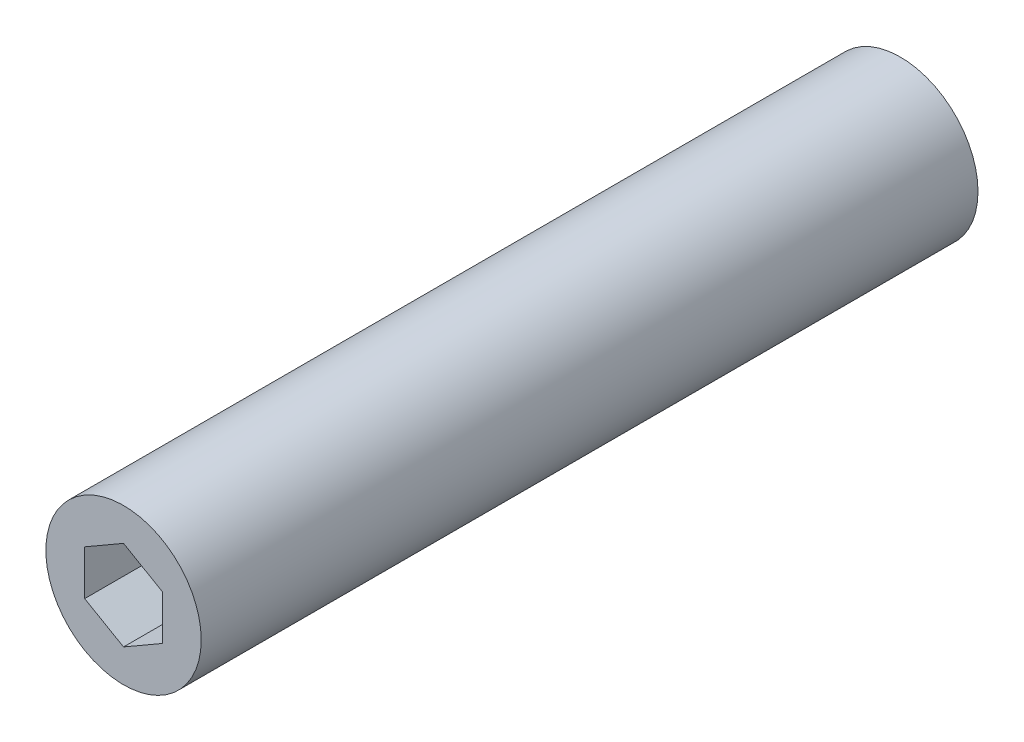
ISO-10303-21;
HEADER;
FILE_DESCRIPTION(('STEP AP214'),'2;1');
FILE_NAME('part.step','',(''),(''),'','','');
FILE_SCHEMA(('AUTOMOTIVE_DESIGN { 1 0 10303 214 1 1 1 1 }'));
ENDSEC;
DATA;
#1=APPLICATION_CONTEXT('core data for automotive mechanical design processes');
#2=APPLICATION_PROTOCOL_DEFINITION('international standard','automotive_design',2000,#1);
#3=PRODUCT_CONTEXT('',#1,'mechanical');
#4=PRODUCT('Part','Part','',(#3));
#5=PRODUCT_RELATED_PRODUCT_CATEGORY('part','',(#4));
#6=PRODUCT_DEFINITION_FORMATION('','',#4);
#7=PRODUCT_DEFINITION_CONTEXT('part definition',#1,'design');
#8=PRODUCT_DEFINITION('design','',#6,#7);
#9=PRODUCT_DEFINITION_SHAPE('','',#8);
#10=(LENGTH_UNIT() NAMED_UNIT(*) SI_UNIT(.MILLI.,.METRE.));
#11=(NAMED_UNIT(*) PLANE_ANGLE_UNIT() SI_UNIT($,.RADIAN.));
#12=(NAMED_UNIT(*) SI_UNIT($,.STERADIAN.) SOLID_ANGLE_UNIT());
#13=UNCERTAINTY_MEASURE_WITH_UNIT(LENGTH_MEASURE(1.E-05),#10,'distance_accuracy_value','');
#14=(GEOMETRIC_REPRESENTATION_CONTEXT(3) GLOBAL_UNCERTAINTY_ASSIGNED_CONTEXT((#13)) GLOBAL_UNIT_ASSIGNED_CONTEXT((#10,
#11,#12)) REPRESENTATION_CONTEXT('',''));
#15=CARTESIAN_POINT('',(0.,0.,0.));
#16=DIRECTION('',(0.,0.,1.));
#17=DIRECTION('',(1.,0.,0.));
#18=AXIS2_PLACEMENT_3D('',#15,#16,#17);
#19=CARTESIAN_POINT('',(0.,0.,40.));
#20=DIRECTION('',(0.,0.,-1.));
#21=DIRECTION('',(1.,0.,0.));
#22=AXIS2_PLACEMENT_3D('',#19,#20,#21);
#23=CYLINDRICAL_SURFACE('',#22,4.);
#24=CARTESIAN_POINT('',(0.,0.,40.));
#25=DIRECTION('',(0.,0.,-1.));
#26=DIRECTION('',(1.,0.,0.));
#27=AXIS2_PLACEMENT_3D('',#24,#25,#26);
#28=CIRCLE('',#27,4.);
#29=CARTESIAN_POINT('',(4.,0.,40.));
#30=VERTEX_POINT('',#29);
#31=EDGE_CURVE('E9',#30,#30,#28,.T.);
#32=ORIENTED_EDGE('',*,*,#31,.T.);
#33=EDGE_LOOP('',(#32));
#34=FACE_BOUND('',#33,.T.);
#35=CARTESIAN_POINT('',(0.,0.,0.));
#36=DIRECTION('',(0.,0.,-1.));
#37=DIRECTION('',(1.,0.,0.));
#38=AXIS2_PLACEMENT_3D('',#35,#36,#37);
#39=CIRCLE('',#38,4.);
#40=CARTESIAN_POINT('',(4.,0.,0.));
#41=VERTEX_POINT('',#40);
#42=EDGE_CURVE('E21',#41,#41,#39,.T.);
#43=ORIENTED_EDGE('',*,*,#42,.F.);
#44=EDGE_LOOP('',(#43));
#45=FACE_BOUND('',#44,.T.);
#46=ADVANCED_FACE('F14',(#34,#45),#23,.T.);
#47=CARTESIAN_POINT('',(0.,0.,40.));
#48=DIRECTION('',(0.,0.,-1.));
#49=DIRECTION('',(1.,0.,0.));
#50=AXIS2_PLACEMENT_3D('',#47,#48,#49);
#51=PLANE('',#50);
#52=DIRECTION('',(0.866025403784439,0.5,0.));
#53=VECTOR('',#52,1.);
#54=CARTESIAN_POINT('',(0.,-2.3094010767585,40.));
#55=LINE('',#54,#53);
#56=CARTESIAN_POINT('',(0.,-2.3094010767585,40.));
#57=VERTEX_POINT('',#56);
#58=CARTESIAN_POINT('',(2.,-1.15470053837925,40.));
#59=VERTEX_POINT('',#58);
#60=EDGE_CURVE('E82',#57,#59,#55,.T.);
#61=ORIENTED_EDGE('',*,*,#60,.F.);
#62=DIRECTION('',(0.866025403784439,-0.5,0.));
#63=VECTOR('',#62,1.);
#64=CARTESIAN_POINT('',(-2.,-1.15470053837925,40.));
#65=LINE('',#64,#63);
#66=CARTESIAN_POINT('',(-2.,-1.15470053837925,40.));
#67=VERTEX_POINT('',#66);
#68=EDGE_CURVE('E28',#67,#57,#65,.T.);
#69=ORIENTED_EDGE('',*,*,#68,.F.);
#70=DIRECTION('',(0.,-1.,0.));
#71=VECTOR('',#70,1.);
#72=CARTESIAN_POINT('',(-2.,1.15470053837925,40.));
#73=LINE('',#72,#71);
#74=CARTESIAN_POINT('',(-2.,1.15470053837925,40.));
#75=VERTEX_POINT('',#74);
#76=EDGE_CURVE('E98',#75,#67,#73,.T.);
#77=ORIENTED_EDGE('',*,*,#76,.F.);
#78=DIRECTION('',(-0.866025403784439,-0.5,0.));
#79=VECTOR('',#78,1.);
#80=CARTESIAN_POINT('',(0.,2.3094010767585,40.));
#81=LINE('',#80,#79);
#82=CARTESIAN_POINT('',(0.,2.3094010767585,40.));
#83=VERTEX_POINT('',#82);
#84=EDGE_CURVE('E92',#83,#75,#81,.T.);
#85=ORIENTED_EDGE('',*,*,#84,.F.);
#86=DIRECTION('',(-0.866025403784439,0.5,0.));
#87=VECTOR('',#86,1.);
#88=CARTESIAN_POINT('',(2.,1.15470053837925,40.));
#89=LINE('',#88,#87);
#90=CARTESIAN_POINT('',(2.,1.15470053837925,40.));
#91=VERTEX_POINT('',#90);
#92=EDGE_CURVE('E90',#91,#83,#89,.T.);
#93=ORIENTED_EDGE('',*,*,#92,.F.);
#94=DIRECTION('',(0.,1.,0.));
#95=VECTOR('',#94,1.);
#96=CARTESIAN_POINT('',(2.,-1.15470053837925,40.));
#97=LINE('',#96,#95);
#98=EDGE_CURVE('E71',#59,#91,#97,.T.);
#99=ORIENTED_EDGE('',*,*,#98,.F.);
#100=EDGE_LOOP('',(#61,#69,#77,#85,#93,#99));
#101=FACE_BOUND('',#100,.T.);
#102=ORIENTED_EDGE('',*,*,#31,.F.);
#103=EDGE_LOOP('',(#102));
#104=FACE_BOUND('',#103,.T.);
#105=ADVANCED_FACE('F86',(#101,#104),#51,.F.);
#106=CARTESIAN_POINT('',(0.,0.,0.));
#107=DIRECTION('',(0.,0.,-1.));
#108=DIRECTION('',(1.,0.,0.));
#109=AXIS2_PLACEMENT_3D('',#106,#107,#108);
#110=PLANE('',#109);
#111=ORIENTED_EDGE('',*,*,#42,.T.);
#112=EDGE_LOOP('',(#111));
#113=FACE_BOUND('',#112,.T.);
#114=ADVANCED_FACE('F124',(#113),#110,.T.);
#115=CARTESIAN_POINT('',(-2.,-1.15470053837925,37.));
#116=DIRECTION('',(-0.5,-0.866025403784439,0.));
#117=DIRECTION('',(-0.866025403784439,0.5,0.));
#118=AXIS2_PLACEMENT_3D('',#115,#116,#117);
#119=PLANE('',#118);
#120=ORIENTED_EDGE('',*,*,#68,.T.);
#121=DIRECTION('',(0.,0.,1.));
#122=VECTOR('',#121,1.);
#123=CARTESIAN_POINT('',(0.,-2.3094010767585,37.));
#124=LINE('',#123,#122);
#125=CARTESIAN_POINT('',(0.,-2.3094010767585,37.));
#126=VERTEX_POINT('',#125);
#127=EDGE_CURVE('E79',#126,#57,#124,.T.);
#128=ORIENTED_EDGE('',*,*,#127,.F.);
#129=DIRECTION('',(0.866025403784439,-0.5,0.));
#130=VECTOR('',#129,1.);
#131=CARTESIAN_POINT('',(-2.,-1.15470053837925,37.));
#132=LINE('',#131,#130);
#133=CARTESIAN_POINT('',(-2.,-1.15470053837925,37.));
#134=VERTEX_POINT('',#133);
#135=EDGE_CURVE('E100',#134,#126,#132,.T.);
#136=ORIENTED_EDGE('',*,*,#135,.F.);
#137=DIRECTION('',(0.,0.,1.));
#138=VECTOR('',#137,1.);
#139=CARTESIAN_POINT('',(-2.,-1.15470053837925,37.));
#140=LINE('',#139,#138);
#141=EDGE_CURVE('E35',#134,#67,#140,.T.);
#142=ORIENTED_EDGE('',*,*,#141,.T.);
#143=EDGE_LOOP('',(#120,#128,#136,#142));
#144=FACE_BOUND('',#143,.T.);
#145=ADVANCED_FACE('F138',(#144),#119,.F.);
#146=CARTESIAN_POINT('',(-2.,1.15470053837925,37.));
#147=DIRECTION('',(-1.,0.,0.));
#148=DIRECTION('',(0.,0.,-1.));
#149=AXIS2_PLACEMENT_3D('',#146,#147,#148);
#150=PLANE('',#149);
#151=ORIENTED_EDGE('',*,*,#76,.T.);
#152=ORIENTED_EDGE('',*,*,#141,.F.);
#153=DIRECTION('',(0.,-1.,0.));
#154=VECTOR('',#153,1.);
#155=CARTESIAN_POINT('',(-2.,1.15470053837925,37.));
#156=LINE('',#155,#154);
#157=CARTESIAN_POINT('',(-2.,1.15470053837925,37.));
#158=VERTEX_POINT('',#157);
#159=EDGE_CURVE('E112',#158,#134,#156,.T.);
#160=ORIENTED_EDGE('',*,*,#159,.F.);
#161=DIRECTION('',(0.,0.,1.));
#162=VECTOR('',#161,1.);
#163=CARTESIAN_POINT('',(-2.,1.15470053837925,37.));
#164=LINE('',#163,#162);
#165=EDGE_CURVE('E116',#158,#75,#164,.T.);
#166=ORIENTED_EDGE('',*,*,#165,.T.);
#167=EDGE_LOOP('',(#151,#152,#160,#166));
#168=FACE_BOUND('',#167,.T.);
#169=ADVANCED_FACE('F143',(#168),#150,.F.);
#170=CARTESIAN_POINT('',(0.,2.3094010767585,37.));
#171=DIRECTION('',(-0.5,0.866025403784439,0.));
#172=DIRECTION('',(0.866025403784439,0.5,0.));
#173=AXIS2_PLACEMENT_3D('',#170,#171,#172);
#174=PLANE('',#173);
#175=ORIENTED_EDGE('',*,*,#84,.T.);
#176=ORIENTED_EDGE('',*,*,#165,.F.);
#177=DIRECTION('',(-0.866025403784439,-0.5,0.));
#178=VECTOR('',#177,1.);
#179=CARTESIAN_POINT('',(0.,2.3094010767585,37.));
#180=LINE('',#179,#178);
#181=CARTESIAN_POINT('',(0.,2.3094010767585,37.));
#182=VERTEX_POINT('',#181);
#183=EDGE_CURVE('E109',#182,#158,#180,.T.);
#184=ORIENTED_EDGE('',*,*,#183,.F.);
#185=DIRECTION('',(0.,0.,1.));
#186=VECTOR('',#185,1.);
#187=CARTESIAN_POINT('',(0.,2.3094010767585,37.));
#188=LINE('',#187,#186);
#189=EDGE_CURVE('E118',#182,#83,#188,.T.);
#190=ORIENTED_EDGE('',*,*,#189,.T.);
#191=EDGE_LOOP('',(#175,#176,#184,#190));
#192=FACE_BOUND('',#191,.T.);
#193=ADVANCED_FACE('F152',(#192),#174,.F.);
#194=CARTESIAN_POINT('',(2.,1.15470053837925,37.));
#195=DIRECTION('',(0.5,0.866025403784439,0.));
#196=DIRECTION('',(0.866025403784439,-0.5,0.));
#197=AXIS2_PLACEMENT_3D('',#194,#195,#196);
#198=PLANE('',#197);
#199=ORIENTED_EDGE('',*,*,#92,.T.);
#200=ORIENTED_EDGE('',*,*,#189,.F.);
#201=DIRECTION('',(-0.866025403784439,0.5,0.));
#202=VECTOR('',#201,1.);
#203=CARTESIAN_POINT('',(2.,1.15470053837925,37.));
#204=LINE('',#203,#202);
#205=CARTESIAN_POINT('',(2.,1.15470053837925,37.));
#206=VERTEX_POINT('',#205);
#207=EDGE_CURVE('E106',#206,#182,#204,.T.);
#208=ORIENTED_EDGE('',*,*,#207,.F.);
#209=DIRECTION('',(0.,0.,1.));
#210=VECTOR('',#209,1.);
#211=CARTESIAN_POINT('',(2.,1.15470053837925,37.));
#212=LINE('',#211,#210);
#213=EDGE_CURVE('E78',#206,#91,#212,.T.);
#214=ORIENTED_EDGE('',*,*,#213,.T.);
#215=EDGE_LOOP('',(#199,#200,#208,#214));
#216=FACE_BOUND('',#215,.T.);
#217=ADVANCED_FACE('F149',(#216),#198,.F.);
#218=CARTESIAN_POINT('',(2.,-1.15470053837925,37.));
#219=DIRECTION('',(1.,0.,0.));
#220=DIRECTION('',(0.,0.,1.));
#221=AXIS2_PLACEMENT_3D('',#218,#219,#220);
#222=PLANE('',#221);
#223=ORIENTED_EDGE('',*,*,#98,.T.);
#224=ORIENTED_EDGE('',*,*,#213,.F.);
#225=DIRECTION('',(0.,1.,0.));
#226=VECTOR('',#225,1.);
#227=CARTESIAN_POINT('',(2.,-1.15470053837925,37.));
#228=LINE('',#227,#226);
#229=CARTESIAN_POINT('',(2.,-1.15470053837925,37.));
#230=VERTEX_POINT('',#229);
#231=EDGE_CURVE('E74',#230,#206,#228,.T.);
#232=ORIENTED_EDGE('',*,*,#231,.F.);
#233=DIRECTION('',(0.,0.,1.));
#234=VECTOR('',#233,1.);
#235=CARTESIAN_POINT('',(2.,-1.15470053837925,37.));
#236=LINE('',#235,#234);
#237=EDGE_CURVE('E67',#230,#59,#236,.T.);
#238=ORIENTED_EDGE('',*,*,#237,.T.);
#239=EDGE_LOOP('',(#223,#224,#232,#238));
#240=FACE_BOUND('',#239,.T.);
#241=ADVANCED_FACE('F69',(#240),#222,.F.);
#242=CARTESIAN_POINT('',(0.,-2.3094010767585,37.));
#243=DIRECTION('',(0.5,-0.866025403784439,0.));
#244=DIRECTION('',(-0.866025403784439,-0.5,0.));
#245=AXIS2_PLACEMENT_3D('',#242,#243,#244);
#246=PLANE('',#245);
#247=ORIENTED_EDGE('',*,*,#60,.T.);
#248=ORIENTED_EDGE('',*,*,#237,.F.);
#249=DIRECTION('',(0.866025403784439,0.5,0.));
#250=VECTOR('',#249,1.);
#251=CARTESIAN_POINT('',(0.,-2.3094010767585,37.));
#252=LINE('',#251,#250);
#253=EDGE_CURVE('E103',#126,#230,#252,.T.);
#254=ORIENTED_EDGE('',*,*,#253,.F.);
#255=ORIENTED_EDGE('',*,*,#127,.T.);
#256=EDGE_LOOP('',(#247,#248,#254,#255));
#257=FACE_BOUND('',#256,.T.);
#258=ADVANCED_FACE('F83',(#257),#246,.F.);
#259=CARTESIAN_POINT('',(2.,-3.46410161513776,37.));
#260=DIRECTION('',(0.,0.,1.));
#261=DIRECTION('',(-1.,0.,0.));
#262=AXIS2_PLACEMENT_3D('',#259,#260,#261);
#263=PLANE('',#262);
#264=ORIENTED_EDGE('',*,*,#135,.T.);
#265=ORIENTED_EDGE('',*,*,#253,.T.);
#266=ORIENTED_EDGE('',*,*,#231,.T.);
#267=ORIENTED_EDGE('',*,*,#207,.T.);
#268=ORIENTED_EDGE('',*,*,#183,.T.);
#269=ORIENTED_EDGE('',*,*,#159,.T.);
#270=EDGE_LOOP('',(#264,#265,#266,#267,#268,#269));
#271=FACE_BOUND('',#270,.T.);
#272=ADVANCED_FACE('F146',(#271),#263,.T.);
#273=CLOSED_SHELL('',(#46,#105,#114,#145,#169,#193,#217,#241,#258,#272));
#274=MANIFOLD_SOLID_BREP('B1',#273);
#275=ADVANCED_BREP_SHAPE_REPRESENTATION('',(#18,#274),#14);
#276=SHAPE_DEFINITION_REPRESENTATION(#9,#275);
ENDSEC;
END-ISO-10303-21;
